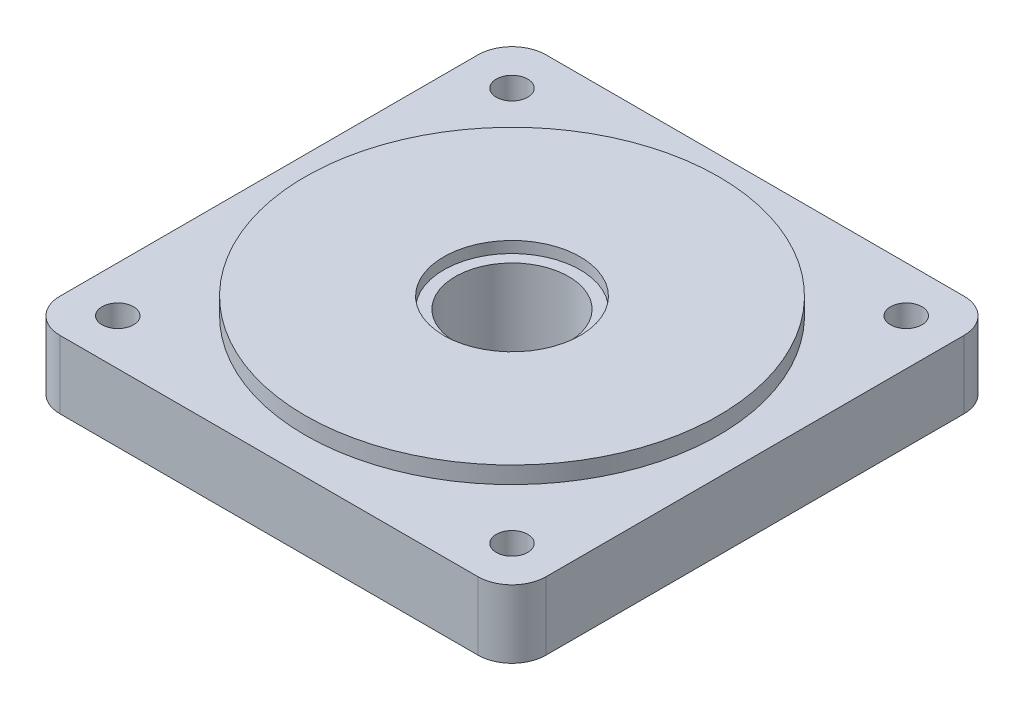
ISO-10303-21;
HEADER;
FILE_DESCRIPTION(('STEP AP214'),'2;1');
FILE_NAME('part.step','',(''),(''),'','','');
FILE_SCHEMA(('AUTOMOTIVE_DESIGN { 1 0 10303 214 1 1 1 1 }'));
ENDSEC;
DATA;
#1=APPLICATION_CONTEXT('core data for automotive mechanical design processes');
#2=APPLICATION_PROTOCOL_DEFINITION('international standard','automotive_design',2000,#1);
#3=PRODUCT_CONTEXT('',#1,'mechanical');
#4=PRODUCT('Part','Part','',(#3));
#5=PRODUCT_RELATED_PRODUCT_CATEGORY('part','',(#4));
#6=PRODUCT_DEFINITION_FORMATION('','',#4);
#7=PRODUCT_DEFINITION_CONTEXT('part definition',#1,'design');
#8=PRODUCT_DEFINITION('design','',#6,#7);
#9=PRODUCT_DEFINITION_SHAPE('','',#8);
#10=(LENGTH_UNIT() NAMED_UNIT(*) SI_UNIT(.MILLI.,.METRE.));
#11=(NAMED_UNIT(*) PLANE_ANGLE_UNIT() SI_UNIT($,.RADIAN.));
#12=(NAMED_UNIT(*) SI_UNIT($,.STERADIAN.) SOLID_ANGLE_UNIT());
#13=UNCERTAINTY_MEASURE_WITH_UNIT(LENGTH_MEASURE(1.E-05),#10,'distance_accuracy_value','');
#14=(GEOMETRIC_REPRESENTATION_CONTEXT(3) GLOBAL_UNCERTAINTY_ASSIGNED_CONTEXT((#13)) GLOBAL_UNIT_ASSIGNED_CONTEXT((#10,
#11,#12)) REPRESENTATION_CONTEXT('',''));
#15=CARTESIAN_POINT('',(0.,0.,0.));
#16=DIRECTION('',(0.,0.,1.));
#17=DIRECTION('',(1.,0.,0.));
#18=AXIS2_PLACEMENT_3D('',#15,#16,#17);
#19=CARTESIAN_POINT('',(0.,-0.001000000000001,0.));
#20=DIRECTION('',(0.,1.,0.));
#21=DIRECTION('',(0.,0.,1.));
#22=AXIS2_PLACEMENT_3D('',#19,#20,#21);
#23=CYLINDRICAL_SURFACE('',#22,10.00125);
#24=CARTESIAN_POINT('',(0.,0.,0.));
#25=DIRECTION('',(0.,1.,0.));
#26=DIRECTION('',(0.,0.,1.));
#27=AXIS2_PLACEMENT_3D('',#24,#25,#26);
#28=CIRCLE('',#27,10.00125);
#29=CARTESIAN_POINT('',(0.,0.,10.00125));
#30=VERTEX_POINT('',#29);
#31=EDGE_CURVE('E158',#30,#30,#28,.F.);
#32=ORIENTED_EDGE('',*,*,#31,.T.);
#33=EDGE_LOOP('',(#32));
#34=FACE_BOUND('',#33,.T.);
#35=CARTESIAN_POINT('',(0.,14.,0.));
#36=DIRECTION('',(0.,1.,0.));
#37=DIRECTION('',(0.,0.,1.));
#38=AXIS2_PLACEMENT_3D('',#35,#36,#37);
#39=CIRCLE('',#38,10.00125);
#40=CARTESIAN_POINT('',(0.,14.,10.00125));
#41=VERTEX_POINT('',#40);
#42=EDGE_CURVE('E20',#41,#41,#39,.F.);
#43=ORIENTED_EDGE('',*,*,#42,.F.);
#44=EDGE_LOOP('',(#43));
#45=FACE_BOUND('',#44,.T.);
#46=ADVANCED_FACE('F16',(#34,#45),#23,.F.);
#47=CARTESIAN_POINT('',(-42.9,13.,42.9));
#48=DIRECTION('',(0.,1.,0.));
#49=DIRECTION('',(0.,0.,1.));
#50=AXIS2_PLACEMENT_3D('',#47,#48,#49);
#51=PLANE('',#50);
#52=CARTESIAN_POINT('',(34.798492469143,13.,34.798492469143));
#53=DIRECTION('',(0.,1.,0.));
#54=DIRECTION('',(0.,0.,1.));
#55=AXIS2_PLACEMENT_3D('',#52,#53,#54);
#56=CIRCLE('',#55,2.77876);
#57=CARTESIAN_POINT('',(34.798492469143,13.,37.577252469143));
#58=VERTEX_POINT('',#57);
#59=EDGE_CURVE('E152',#58,#58,#56,.T.);
#60=ORIENTED_EDGE('',*,*,#59,.F.);
#61=EDGE_LOOP('',(#60));
#62=FACE_BOUND('',#61,.T.);
#63=CARTESIAN_POINT('',(-34.798492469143,13.,-34.798492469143));
#64=DIRECTION('',(0.,1.,0.));
#65=DIRECTION('',(0.,0.,1.));
#66=AXIS2_PLACEMENT_3D('',#63,#64,#65);
#67=CIRCLE('',#66,2.77876);
#68=CARTESIAN_POINT('',(-34.798492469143,13.,-32.019732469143));
#69=VERTEX_POINT('',#68);
#70=EDGE_CURVE('E149',#69,#69,#67,.T.);
#71=ORIENTED_EDGE('',*,*,#70,.F.);
#72=EDGE_LOOP('',(#71));
#73=FACE_BOUND('',#72,.T.);
#74=CARTESIAN_POINT('',(34.798492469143,13.,-34.798492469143));
#75=DIRECTION('',(0.,1.,0.));
#76=DIRECTION('',(0.,0.,1.));
#77=AXIS2_PLACEMENT_3D('',#74,#75,#76);
#78=CIRCLE('',#77,2.77876);
#79=CARTESIAN_POINT('',(34.798492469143,13.,-32.019732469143));
#80=VERTEX_POINT('',#79);
#81=EDGE_CURVE('E146',#80,#80,#78,.T.);
#82=ORIENTED_EDGE('',*,*,#81,.F.);
#83=EDGE_LOOP('',(#82));
#84=FACE_BOUND('',#83,.T.);
#85=CARTESIAN_POINT('',(-34.798492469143,13.,34.798492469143));
#86=DIRECTION('',(0.,1.,0.));
#87=DIRECTION('',(0.,0.,1.));
#88=AXIS2_PLACEMENT_3D('',#85,#86,#87);
#89=CIRCLE('',#88,2.77876);
#90=CARTESIAN_POINT('',(-34.798492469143,13.,37.577252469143));
#91=VERTEX_POINT('',#90);
#92=EDGE_CURVE('E142',#91,#91,#89,.T.);
#93=ORIENTED_EDGE('',*,*,#92,.F.);
#94=EDGE_LOOP('',(#93));
#95=FACE_BOUND('',#94,.T.);
#96=DIRECTION('',(0.,0.,1.));
#97=VECTOR('',#96,1.);
#98=CARTESIAN_POINT('',(-42.9,13.,-42.9));
#99=LINE('',#98,#97);
#100=CARTESIAN_POINT('',(-42.9,13.,-36.9));
#101=VERTEX_POINT('',#100);
#102=CARTESIAN_POINT('',(-42.9,13.,36.9));
#103=VERTEX_POINT('',#102);
#104=EDGE_CURVE('E184',#101,#103,#99,.T.);
#105=ORIENTED_EDGE('',*,*,#104,.T.);
#106=CARTESIAN_POINT('',(-36.9,13.,36.9));
#107=DIRECTION('',(0.,1.,0.));
#108=DIRECTION('',(0.,0.,1.));
#109=AXIS2_PLACEMENT_3D('',#106,#107,#108);
#110=CIRCLE('',#109,6.);
#111=CARTESIAN_POINT('',(-36.9,13.,42.9));
#112=VERTEX_POINT('',#111);
#113=EDGE_CURVE('E131',#103,#112,#110,.T.);
#114=ORIENTED_EDGE('',*,*,#113,.T.);
#115=DIRECTION('',(1.,0.,0.));
#116=VECTOR('',#115,1.);
#117=CARTESIAN_POINT('',(-42.9,13.,42.9));
#118=LINE('',#117,#116);
#119=CARTESIAN_POINT('',(36.9,13.,42.9));
#120=VERTEX_POINT('',#119);
#121=EDGE_CURVE('E187',#112,#120,#118,.T.);
#122=ORIENTED_EDGE('',*,*,#121,.T.);
#123=CARTESIAN_POINT('',(36.9,13.,36.9));
#124=DIRECTION('',(0.,1.,0.));
#125=DIRECTION('',(0.,0.,1.));
#126=AXIS2_PLACEMENT_3D('',#123,#124,#125);
#127=CIRCLE('',#126,6.);
#128=CARTESIAN_POINT('',(42.9,13.,36.9));
#129=VERTEX_POINT('',#128);
#130=EDGE_CURVE('E109',#120,#129,#127,.T.);
#131=ORIENTED_EDGE('',*,*,#130,.T.);
#132=DIRECTION('',(0.,0.,-1.));
#133=VECTOR('',#132,1.);
#134=CARTESIAN_POINT('',(42.9,13.,-42.9));
#135=LINE('',#134,#133);
#136=CARTESIAN_POINT('',(42.9,13.,-36.9));
#137=VERTEX_POINT('',#136);
#138=EDGE_CURVE('E189',#129,#137,#135,.T.);
#139=ORIENTED_EDGE('',*,*,#138,.T.);
#140=CARTESIAN_POINT('',(36.9,13.,-36.9));
#141=DIRECTION('',(0.,1.,0.));
#142=DIRECTION('',(0.,0.,1.));
#143=AXIS2_PLACEMENT_3D('',#140,#141,#142);
#144=CIRCLE('',#143,6.);
#145=CARTESIAN_POINT('',(36.9,13.,-42.9));
#146=VERTEX_POINT('',#145);
#147=EDGE_CURVE('E39',#137,#146,#144,.T.);
#148=ORIENTED_EDGE('',*,*,#147,.T.);
#149=DIRECTION('',(-1.,0.,0.));
#150=VECTOR('',#149,1.);
#151=CARTESIAN_POINT('',(-42.9,13.,-42.9));
#152=LINE('',#151,#150);
#153=CARTESIAN_POINT('',(-36.9,13.,-42.9));
#154=VERTEX_POINT('',#153);
#155=EDGE_CURVE('E115',#146,#154,#152,.T.);
#156=ORIENTED_EDGE('',*,*,#155,.T.);
#157=CARTESIAN_POINT('',(-36.9,13.,-36.9));
#158=DIRECTION('',(0.,1.,0.));
#159=DIRECTION('',(0.,0.,1.));
#160=AXIS2_PLACEMENT_3D('',#157,#158,#159);
#161=CIRCLE('',#160,6.);
#162=EDGE_CURVE('E127',#154,#101,#161,.T.);
#163=ORIENTED_EDGE('',*,*,#162,.T.);
#164=EDGE_LOOP('',(#105,#114,#122,#131,#139,#148,#156,#163));
#165=FACE_BOUND('',#164,.T.);
#166=CARTESIAN_POINT('',(0.,13.,0.));
#167=DIRECTION('',(0.,1.,0.));
#168=DIRECTION('',(0.,0.,1.));
#169=AXIS2_PLACEMENT_3D('',#166,#167,#168);
#170=CIRCLE('',#169,36.5125);
#171=CARTESIAN_POINT('',(0.,13.,36.5125));
#172=VERTEX_POINT('',#171);
#173=EDGE_CURVE('E141',#172,#172,#170,.T.);
#174=ORIENTED_EDGE('',*,*,#173,.F.);
#175=EDGE_LOOP('',(#174));
#176=FACE_BOUND('',#175,.T.);
#177=ADVANCED_FACE('F191',(#62,#73,#84,#95,#165,#176),#51,.T.);
#178=CARTESIAN_POINT('',(-42.9,13.,-42.9));
#179=DIRECTION('',(1.,0.,0.));
#180=DIRECTION('',(0.,0.,-1.));
#181=AXIS2_PLACEMENT_3D('',#178,#179,#180);
#182=PLANE('',#181);
#183=DIRECTION('',(0.,0.,-1.));
#184=VECTOR('',#183,1.);
#185=CARTESIAN_POINT('',(-42.9,0.999999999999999,-42.9));
#186=LINE('',#185,#184);
#187=CARTESIAN_POINT('',(-42.9,0.999999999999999,36.9));
#188=VERTEX_POINT('',#187);
#189=CARTESIAN_POINT('',(-42.9,0.999999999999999,-36.9));
#190=VERTEX_POINT('',#189);
#191=EDGE_CURVE('E105',#188,#190,#186,.T.);
#192=ORIENTED_EDGE('',*,*,#191,.F.);
#193=DIRECTION('',(0.,-1.,0.));
#194=VECTOR('',#193,1.);
#195=CARTESIAN_POINT('',(-42.9,13.,36.9));
#196=LINE('',#195,#194);
#197=EDGE_CURVE('E125',#188,#103,#196,.F.);
#198=ORIENTED_EDGE('',*,*,#197,.T.);
#199=ORIENTED_EDGE('',*,*,#104,.F.);
#200=DIRECTION('',(0.,-1.,0.));
#201=VECTOR('',#200,1.);
#202=CARTESIAN_POINT('',(-42.9,13.,-36.9));
#203=LINE('',#202,#201);
#204=EDGE_CURVE('E122',#101,#190,#203,.T.);
#205=ORIENTED_EDGE('',*,*,#204,.T.);
#206=EDGE_LOOP('',(#192,#198,#199,#205));
#207=FACE_BOUND('',#206,.T.);
#208=ADVANCED_FACE('F18',(#207),#182,.F.);
#209=CARTESIAN_POINT('',(-42.9,13.,42.9));
#210=DIRECTION('',(0.,0.,-1.));
#211=DIRECTION('',(-1.,0.,0.));
#212=AXIS2_PLACEMENT_3D('',#209,#210,#211);
#213=PLANE('',#212);
#214=ORIENTED_EDGE('',*,*,#121,.F.);
#215=DIRECTION('',(0.,-1.,0.));
#216=VECTOR('',#215,1.);
#217=CARTESIAN_POINT('',(-36.9,13.,42.9));
#218=LINE('',#217,#216);
#219=CARTESIAN_POINT('',(-36.9,0.999999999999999,42.9));
#220=VERTEX_POINT('',#219);
#221=EDGE_CURVE('E104',#112,#220,#218,.T.);
#222=ORIENTED_EDGE('',*,*,#221,.T.);
#223=DIRECTION('',(-1.,0.,0.));
#224=VECTOR('',#223,1.);
#225=CARTESIAN_POINT('',(-42.9,0.999999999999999,42.9));
#226=LINE('',#225,#224);
#227=CARTESIAN_POINT('',(36.9,0.999999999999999,42.9));
#228=VERTEX_POINT('',#227);
#229=EDGE_CURVE('E87',#228,#220,#226,.T.);
#230=ORIENTED_EDGE('',*,*,#229,.F.);
#231=DIRECTION('',(0.,-1.,0.));
#232=VECTOR('',#231,1.);
#233=CARTESIAN_POINT('',(36.9,13.,42.9));
#234=LINE('',#233,#232);
#235=EDGE_CURVE('E101',#228,#120,#234,.F.);
#236=ORIENTED_EDGE('',*,*,#235,.T.);
#237=EDGE_LOOP('',(#214,#222,#230,#236));
#238=FACE_BOUND('',#237,.T.);
#239=ADVANCED_FACE('F100',(#238),#213,.F.);
#240=CARTESIAN_POINT('',(42.9,13.,-42.9));
#241=DIRECTION('',(-1.,0.,0.));
#242=DIRECTION('',(0.,0.,1.));
#243=AXIS2_PLACEMENT_3D('',#240,#241,#242);
#244=PLANE('',#243);
#245=ORIENTED_EDGE('',*,*,#138,.F.);
#246=DIRECTION('',(0.,-1.,0.));
#247=VECTOR('',#246,1.);
#248=CARTESIAN_POINT('',(42.9,13.,36.9));
#249=LINE('',#248,#247);
#250=CARTESIAN_POINT('',(42.9,0.999999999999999,36.9));
#251=VERTEX_POINT('',#250);
#252=EDGE_CURVE('E135',#129,#251,#249,.T.);
#253=ORIENTED_EDGE('',*,*,#252,.T.);
#254=DIRECTION('',(0.,0.,1.));
#255=VECTOR('',#254,1.);
#256=CARTESIAN_POINT('',(42.9,0.999999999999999,-42.9));
#257=LINE('',#256,#255);
#258=CARTESIAN_POINT('',(42.9,0.999999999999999,-36.9));
#259=VERTEX_POINT('',#258);
#260=EDGE_CURVE('E89',#259,#251,#257,.T.);
#261=ORIENTED_EDGE('',*,*,#260,.F.);
#262=DIRECTION('',(0.,-1.,0.));
#263=VECTOR('',#262,1.);
#264=CARTESIAN_POINT('',(42.9,13.,-36.9));
#265=LINE('',#264,#263);
#266=EDGE_CURVE('E133',#259,#137,#265,.F.);
#267=ORIENTED_EDGE('',*,*,#266,.T.);
#268=EDGE_LOOP('',(#245,#253,#261,#267));
#269=FACE_BOUND('',#268,.T.);
#270=ADVANCED_FACE('F206',(#269),#244,.F.);
#271=CARTESIAN_POINT('',(-42.9,13.,-42.9));
#272=DIRECTION('',(0.,0.,1.));
#273=DIRECTION('',(1.,0.,0.));
#274=AXIS2_PLACEMENT_3D('',#271,#272,#273);
#275=PLANE('',#274);
#276=ORIENTED_EDGE('',*,*,#155,.F.);
#277=DIRECTION('',(0.,-1.,0.));
#278=VECTOR('',#277,1.);
#279=CARTESIAN_POINT('',(36.9,13.,-42.9));
#280=LINE('',#279,#278);
#281=CARTESIAN_POINT('',(36.9,0.999999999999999,-42.9));
#282=VERTEX_POINT('',#281);
#283=EDGE_CURVE('E10',#146,#282,#280,.T.);
#284=ORIENTED_EDGE('',*,*,#283,.T.);
#285=DIRECTION('',(1.,0.,0.));
#286=VECTOR('',#285,1.);
#287=CARTESIAN_POINT('',(-42.9,0.999999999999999,-42.9));
#288=LINE('',#287,#286);
#289=CARTESIAN_POINT('',(-36.9,0.999999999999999,-42.9));
#290=VERTEX_POINT('',#289);
#291=EDGE_CURVE('E110',#290,#282,#288,.T.);
#292=ORIENTED_EDGE('',*,*,#291,.F.);
#293=DIRECTION('',(0.,-1.,0.));
#294=VECTOR('',#293,1.);
#295=CARTESIAN_POINT('',(-36.9,13.,-42.9));
#296=LINE('',#295,#294);
#297=EDGE_CURVE('E25',#290,#154,#296,.F.);
#298=ORIENTED_EDGE('',*,*,#297,.T.);
#299=EDGE_LOOP('',(#276,#284,#292,#298));
#300=FACE_BOUND('',#299,.T.);
#301=ADVANCED_FACE('F210',(#300),#275,.F.);
#302=CARTESIAN_POINT('',(0.,1.,0.));
#303=DIRECTION('',(0.,-1.,0.));
#304=DIRECTION('',(0.,0.,-1.));
#305=AXIS2_PLACEMENT_3D('',#302,#303,#304);
#306=PLANE('',#305);
#307=CARTESIAN_POINT('',(34.798492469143,0.999999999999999,34.798492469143));
#308=DIRECTION('',(0.,-1.,0.));
#309=DIRECTION('',(0.,0.,-1.));
#310=AXIS2_PLACEMENT_3D('',#307,#308,#309);
#311=CIRCLE('',#310,2.77875999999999);
#312=CARTESIAN_POINT('',(34.798492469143,0.999999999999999,32.019732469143));
#313=VERTEX_POINT('',#312);
#314=EDGE_CURVE('E150',#313,#313,#311,.T.);
#315=ORIENTED_EDGE('',*,*,#314,.F.);
#316=EDGE_LOOP('',(#315));
#317=FACE_BOUND('',#316,.T.);
#318=CARTESIAN_POINT('',(-34.798492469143,0.999999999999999,-34.798492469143));
#319=DIRECTION('',(0.,-1.,0.));
#320=DIRECTION('',(0.,0.,-1.));
#321=AXIS2_PLACEMENT_3D('',#318,#319,#320);
#322=CIRCLE('',#321,2.77875999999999);
#323=CARTESIAN_POINT('',(-34.798492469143,0.999999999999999,-37.577252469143));
#324=VERTEX_POINT('',#323);
#325=EDGE_CURVE('E147',#324,#324,#322,.T.);
#326=ORIENTED_EDGE('',*,*,#325,.F.);
#327=EDGE_LOOP('',(#326));
#328=FACE_BOUND('',#327,.T.);
#329=CARTESIAN_POINT('',(34.798492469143,0.999999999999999,-34.798492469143));
#330=DIRECTION('',(0.,-1.,0.));
#331=DIRECTION('',(0.,0.,-1.));
#332=AXIS2_PLACEMENT_3D('',#329,#330,#331);
#333=CIRCLE('',#332,2.77875999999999);
#334=CARTESIAN_POINT('',(34.798492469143,0.999999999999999,-37.577252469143));
#335=VERTEX_POINT('',#334);
#336=EDGE_CURVE('E143',#335,#335,#333,.T.);
#337=ORIENTED_EDGE('',*,*,#336,.F.);
#338=EDGE_LOOP('',(#337));
#339=FACE_BOUND('',#338,.T.);
#340=CARTESIAN_POINT('',(-34.798492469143,0.999999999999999,34.798492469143));
#341=DIRECTION('',(0.,-1.,0.));
#342=DIRECTION('',(0.,0.,-1.));
#343=AXIS2_PLACEMENT_3D('',#340,#341,#342);
#344=CIRCLE('',#343,2.77875999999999);
#345=CARTESIAN_POINT('',(-34.798492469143,0.999999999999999,32.019732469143));
#346=VERTEX_POINT('',#345);
#347=EDGE_CURVE('E138',#346,#346,#344,.T.);
#348=ORIENTED_EDGE('',*,*,#347,.F.);
#349=EDGE_LOOP('',(#348));
#350=FACE_BOUND('',#349,.T.);
#351=CARTESIAN_POINT('',(0.,1.,0.));
#352=DIRECTION('',(0.,-1.,0.));
#353=DIRECTION('',(0.,0.,-1.));
#354=AXIS2_PLACEMENT_3D('',#351,#352,#353);
#355=CIRCLE('',#354,40.625);
#356=CARTESIAN_POINT('',(0.,1.,-40.625));
#357=VERTEX_POINT('',#356);
#358=EDGE_CURVE('E178',#357,#357,#355,.T.);
#359=ORIENTED_EDGE('',*,*,#358,.F.);
#360=EDGE_LOOP('',(#359));
#361=FACE_BOUND('',#360,.T.);
#362=ORIENTED_EDGE('',*,*,#229,.T.);
#363=CARTESIAN_POINT('',(-36.9,0.999999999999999,36.9));
#364=DIRECTION('',(0.,-1.,0.));
#365=DIRECTION('',(0.,0.,-1.));
#366=AXIS2_PLACEMENT_3D('',#363,#364,#365);
#367=CIRCLE('',#366,6.);
#368=EDGE_CURVE('E94',#220,#188,#367,.T.);
#369=ORIENTED_EDGE('',*,*,#368,.T.);
#370=ORIENTED_EDGE('',*,*,#191,.T.);
#371=CARTESIAN_POINT('',(-36.9,0.999999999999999,-36.9));
#372=DIRECTION('',(0.,-1.,0.));
#373=DIRECTION('',(0.,0.,-1.));
#374=AXIS2_PLACEMENT_3D('',#371,#372,#373);
#375=CIRCLE('',#374,6.);
#376=EDGE_CURVE('E112',#190,#290,#375,.T.);
#377=ORIENTED_EDGE('',*,*,#376,.T.);
#378=ORIENTED_EDGE('',*,*,#291,.T.);
#379=CARTESIAN_POINT('',(36.9,0.999999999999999,-36.9));
#380=DIRECTION('',(0.,-1.,0.));
#381=DIRECTION('',(0.,0.,-1.));
#382=AXIS2_PLACEMENT_3D('',#379,#380,#381);
#383=CIRCLE('',#382,6.);
#384=EDGE_CURVE('E95',#282,#259,#383,.T.);
#385=ORIENTED_EDGE('',*,*,#384,.T.);
#386=ORIENTED_EDGE('',*,*,#260,.T.);
#387=CARTESIAN_POINT('',(36.9,0.999999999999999,36.9));
#388=DIRECTION('',(0.,-1.,0.));
#389=DIRECTION('',(0.,0.,-1.));
#390=AXIS2_PLACEMENT_3D('',#387,#388,#389);
#391=CIRCLE('',#390,6.);
#392=EDGE_CURVE('E84',#251,#228,#391,.T.);
#393=ORIENTED_EDGE('',*,*,#392,.T.);
#394=EDGE_LOOP('',(#362,#369,#370,#377,#378,#385,#386,#393));
#395=FACE_BOUND('',#394,.T.);
#396=ADVANCED_FACE('F86',(#317,#328,#339,#350,#361,#395),#306,.T.);
#397=CARTESIAN_POINT('',(0.,1.,0.));
#398=DIRECTION('',(0.,-1.,0.));
#399=DIRECTION('',(0.,0.,-1.));
#400=AXIS2_PLACEMENT_3D('',#397,#398,#399);
#401=CYLINDRICAL_SURFACE('',#400,40.625);
#402=ORIENTED_EDGE('',*,*,#358,.T.);
#403=EDGE_LOOP('',(#402));
#404=FACE_BOUND('',#403,.T.);
#405=CARTESIAN_POINT('',(0.,0.,0.));
#406=DIRECTION('',(0.,-1.,0.));
#407=DIRECTION('',(0.,0.,-1.));
#408=AXIS2_PLACEMENT_3D('',#405,#406,#407);
#409=CIRCLE('',#408,40.625);
#410=CARTESIAN_POINT('',(0.,0.,-40.625));
#411=VERTEX_POINT('',#410);
#412=EDGE_CURVE('E175',#411,#411,#409,.T.);
#413=ORIENTED_EDGE('',*,*,#412,.F.);
#414=EDGE_LOOP('',(#413));
#415=FACE_BOUND('',#414,.T.);
#416=ADVANCED_FACE('F219',(#404,#415),#401,.T.);
#417=CARTESIAN_POINT('',(-42.9,0.,42.9));
#418=DIRECTION('',(0.,1.,0.));
#419=DIRECTION('',(0.,0.,1.));
#420=AXIS2_PLACEMENT_3D('',#417,#418,#419);
#421=PLANE('',#420);
#422=ORIENTED_EDGE('',*,*,#31,.F.);
#423=EDGE_LOOP('',(#422));
#424=FACE_BOUND('',#423,.T.);
#425=ORIENTED_EDGE('',*,*,#412,.T.);
#426=EDGE_LOOP('',(#425));
#427=FACE_BOUND('',#426,.T.);
#428=ADVANCED_FACE('F268',(#424,#427),#421,.F.);
#429=CARTESIAN_POINT('',(0.,16.,0.));
#430=DIRECTION('',(0.,-1.,0.));
#431=DIRECTION('',(0.,0.,-1.));
#432=AXIS2_PLACEMENT_3D('',#429,#430,#431);
#433=CYLINDRICAL_SURFACE('',#432,36.5125);
#434=CARTESIAN_POINT('',(0.,16.,0.));
#435=DIRECTION('',(0.,1.,0.));
#436=DIRECTION('',(0.,0.,1.));
#437=AXIS2_PLACEMENT_3D('',#434,#435,#436);
#438=CIRCLE('',#437,36.5125);
#439=CARTESIAN_POINT('',(0.,16.,36.5125));
#440=VERTEX_POINT('',#439);
#441=EDGE_CURVE('E172',#440,#440,#438,.T.);
#442=ORIENTED_EDGE('',*,*,#441,.F.);
#443=EDGE_LOOP('',(#442));
#444=FACE_BOUND('',#443,.T.);
#445=ORIENTED_EDGE('',*,*,#173,.T.);
#446=EDGE_LOOP('',(#445));
#447=FACE_BOUND('',#446,.T.);
#448=ADVANCED_FACE('F264',(#444,#447),#433,.T.);
#449=CARTESIAN_POINT('',(0.,16.,0.));
#450=DIRECTION('',(0.,1.,0.));
#451=DIRECTION('',(0.,0.,1.));
#452=AXIS2_PLACEMENT_3D('',#449,#450,#451);
#453=PLANE('',#452);
#454=CARTESIAN_POINT('',(0.,16.,0.));
#455=DIRECTION('',(0.,1.,0.));
#456=DIRECTION('',(0.,0.,1.));
#457=AXIS2_PLACEMENT_3D('',#454,#455,#456);
#458=CIRCLE('',#457,12.042433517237);
#459=CARTESIAN_POINT('',(0.,16.,12.042433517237));
#460=VERTEX_POINT('',#459);
#461=EDGE_CURVE('E418',#460,#460,#458,.T.);
#462=ORIENTED_EDGE('',*,*,#461,.F.);
#463=EDGE_LOOP('',(#462));
#464=FACE_BOUND('',#463,.T.);
#465=ORIENTED_EDGE('',*,*,#441,.T.);
#466=EDGE_LOOP('',(#465));
#467=FACE_BOUND('',#466,.T.);
#468=ADVANCED_FACE('F261',(#464,#467),#453,.T.);
#469=CARTESIAN_POINT('',(-36.9,13.,36.9));
#470=DIRECTION('',(0.,-1.,0.));
#471=DIRECTION('',(0.,0.,-1.));
#472=AXIS2_PLACEMENT_3D('',#469,#470,#471);
#473=CYLINDRICAL_SURFACE('',#472,6.);
#474=ORIENTED_EDGE('',*,*,#113,.F.);
#475=ORIENTED_EDGE('',*,*,#197,.F.);
#476=ORIENTED_EDGE('',*,*,#368,.F.);
#477=ORIENTED_EDGE('',*,*,#221,.F.);
#478=EDGE_LOOP('',(#474,#475,#476,#477));
#479=FACE_BOUND('',#478,.T.);
#480=ADVANCED_FACE('F203',(#479),#473,.T.);
#481=CARTESIAN_POINT('',(36.9,13.,36.9));
#482=DIRECTION('',(0.,-1.,0.));
#483=DIRECTION('',(0.,0.,-1.));
#484=AXIS2_PLACEMENT_3D('',#481,#482,#483);
#485=CYLINDRICAL_SURFACE('',#484,6.);
#486=ORIENTED_EDGE('',*,*,#130,.F.);
#487=ORIENTED_EDGE('',*,*,#235,.F.);
#488=ORIENTED_EDGE('',*,*,#392,.F.);
#489=ORIENTED_EDGE('',*,*,#252,.F.);
#490=EDGE_LOOP('',(#486,#487,#488,#489));
#491=FACE_BOUND('',#490,.T.);
#492=ADVANCED_FACE('F108',(#491),#485,.T.);
#493=CARTESIAN_POINT('',(36.9,13.,-36.9));
#494=DIRECTION('',(0.,-1.,0.));
#495=DIRECTION('',(0.,0.,-1.));
#496=AXIS2_PLACEMENT_3D('',#493,#494,#495);
#497=CYLINDRICAL_SURFACE('',#496,6.);
#498=ORIENTED_EDGE('',*,*,#147,.F.);
#499=ORIENTED_EDGE('',*,*,#266,.F.);
#500=ORIENTED_EDGE('',*,*,#384,.F.);
#501=ORIENTED_EDGE('',*,*,#283,.F.);
#502=EDGE_LOOP('',(#498,#499,#500,#501));
#503=FACE_BOUND('',#502,.T.);
#504=ADVANCED_FACE('F209',(#503),#497,.T.);
#505=CARTESIAN_POINT('',(-36.9,13.,-36.9));
#506=DIRECTION('',(0.,-1.,0.));
#507=DIRECTION('',(0.,0.,-1.));
#508=AXIS2_PLACEMENT_3D('',#505,#506,#507);
#509=CYLINDRICAL_SURFACE('',#508,6.);
#510=ORIENTED_EDGE('',*,*,#162,.F.);
#511=ORIENTED_EDGE('',*,*,#297,.F.);
#512=ORIENTED_EDGE('',*,*,#376,.F.);
#513=ORIENTED_EDGE('',*,*,#204,.F.);
#514=EDGE_LOOP('',(#510,#511,#512,#513));
#515=FACE_BOUND('',#514,.T.);
#516=ADVANCED_FACE('F197',(#515),#509,.T.);
#517=CARTESIAN_POINT('',(-34.798492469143,13.,34.798492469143));
#518=DIRECTION('',(0.,1.,0.));
#519=DIRECTION('',(0.,0.,1.));
#520=AXIS2_PLACEMENT_3D('',#517,#518,#519);
#521=CYLINDRICAL_SURFACE('',#520,2.77875999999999);
#522=ORIENTED_EDGE('',*,*,#347,.T.);
#523=EDGE_LOOP('',(#522));
#524=FACE_BOUND('',#523,.T.);
#525=ORIENTED_EDGE('',*,*,#92,.T.);
#526=EDGE_LOOP('',(#525));
#527=FACE_BOUND('',#526,.T.);
#528=ADVANCED_FACE('F248',(#524,#527),#521,.F.);
#529=CARTESIAN_POINT('',(34.798492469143,13.,-34.798492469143));
#530=DIRECTION('',(0.,1.,0.));
#531=DIRECTION('',(0.,0.,1.));
#532=AXIS2_PLACEMENT_3D('',#529,#530,#531);
#533=CYLINDRICAL_SURFACE('',#532,2.77875999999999);
#534=ORIENTED_EDGE('',*,*,#336,.T.);
#535=EDGE_LOOP('',(#534));
#536=FACE_BOUND('',#535,.T.);
#537=ORIENTED_EDGE('',*,*,#81,.T.);
#538=EDGE_LOOP('',(#537));
#539=FACE_BOUND('',#538,.T.);
#540=ADVANCED_FACE('F244',(#536,#539),#533,.F.);
#541=CARTESIAN_POINT('',(-34.798492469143,13.,-34.798492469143));
#542=DIRECTION('',(0.,1.,0.));
#543=DIRECTION('',(0.,0.,1.));
#544=AXIS2_PLACEMENT_3D('',#541,#542,#543);
#545=CYLINDRICAL_SURFACE('',#544,2.77875999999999);
#546=ORIENTED_EDGE('',*,*,#325,.T.);
#547=EDGE_LOOP('',(#546));
#548=FACE_BOUND('',#547,.T.);
#549=ORIENTED_EDGE('',*,*,#70,.T.);
#550=EDGE_LOOP('',(#549));
#551=FACE_BOUND('',#550,.T.);
#552=ADVANCED_FACE('F241',(#548,#551),#545,.F.);
#553=CARTESIAN_POINT('',(34.798492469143,13.,34.798492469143));
#554=DIRECTION('',(0.,1.,0.));
#555=DIRECTION('',(0.,0.,1.));
#556=AXIS2_PLACEMENT_3D('',#553,#554,#555);
#557=CYLINDRICAL_SURFACE('',#556,2.77875999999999);
#558=ORIENTED_EDGE('',*,*,#314,.T.);
#559=EDGE_LOOP('',(#558));
#560=FACE_BOUND('',#559,.T.);
#561=ORIENTED_EDGE('',*,*,#59,.T.);
#562=EDGE_LOOP('',(#561));
#563=FACE_BOUND('',#562,.T.);
#564=ADVANCED_FACE('F237',(#560,#563),#557,.F.);
#565=CARTESIAN_POINT('',(0.,14.,0.));
#566=DIRECTION('',(0.,1.,0.));
#567=DIRECTION('',(0.,0.,1.));
#568=AXIS2_PLACEMENT_3D('',#565,#566,#567);
#569=PLANE('',#568);
#570=CARTESIAN_POINT('',(0.,14.,0.));
#571=DIRECTION('',(0.,1.,0.));
#572=DIRECTION('',(0.,0.,1.));
#573=AXIS2_PLACEMENT_3D('',#570,#571,#572);
#574=CIRCLE('',#573,12.042433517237);
#575=CARTESIAN_POINT('',(0.,14.,12.042433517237));
#576=VERTEX_POINT('',#575);
#577=EDGE_CURVE('E415',#576,#576,#574,.T.);
#578=ORIENTED_EDGE('',*,*,#577,.T.);
#579=EDGE_LOOP('',(#578));
#580=FACE_BOUND('',#579,.T.);
#581=ORIENTED_EDGE('',*,*,#42,.T.);
#582=EDGE_LOOP('',(#581));
#583=FACE_BOUND('',#582,.T.);
#584=ADVANCED_FACE('F240',(#580,#583),#569,.T.);
#585=CARTESIAN_POINT('',(0.,14.,0.));
#586=DIRECTION('',(0.,1.,0.));
#587=DIRECTION('',(0.,0.,1.));
#588=AXIS2_PLACEMENT_3D('',#585,#586,#587);
#589=CYLINDRICAL_SURFACE('',#588,12.042433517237);
#590=ORIENTED_EDGE('',*,*,#577,.F.);
#591=EDGE_LOOP('',(#590));
#592=FACE_BOUND('',#591,.T.);
#593=ORIENTED_EDGE('',*,*,#461,.T.);
#594=EDGE_LOOP('',(#593));
#595=FACE_BOUND('',#594,.T.);
#596=ADVANCED_FACE('F235',(#592,#595),#589,.F.);
#597=CLOSED_SHELL('',(#46,#177,#208,#239,#270,#301,#396,#416,#428,#448,#468,#480,#492,#504,#516,
#528,#540,#552,#564,#584,#596));
#598=MANIFOLD_SOLID_BREP('B1',#597);
#599=ADVANCED_BREP_SHAPE_REPRESENTATION('',(#18,#598),#14);
#600=SHAPE_DEFINITION_REPRESENTATION(#9,#599);
ENDSEC;
END-ISO-10303-21;
